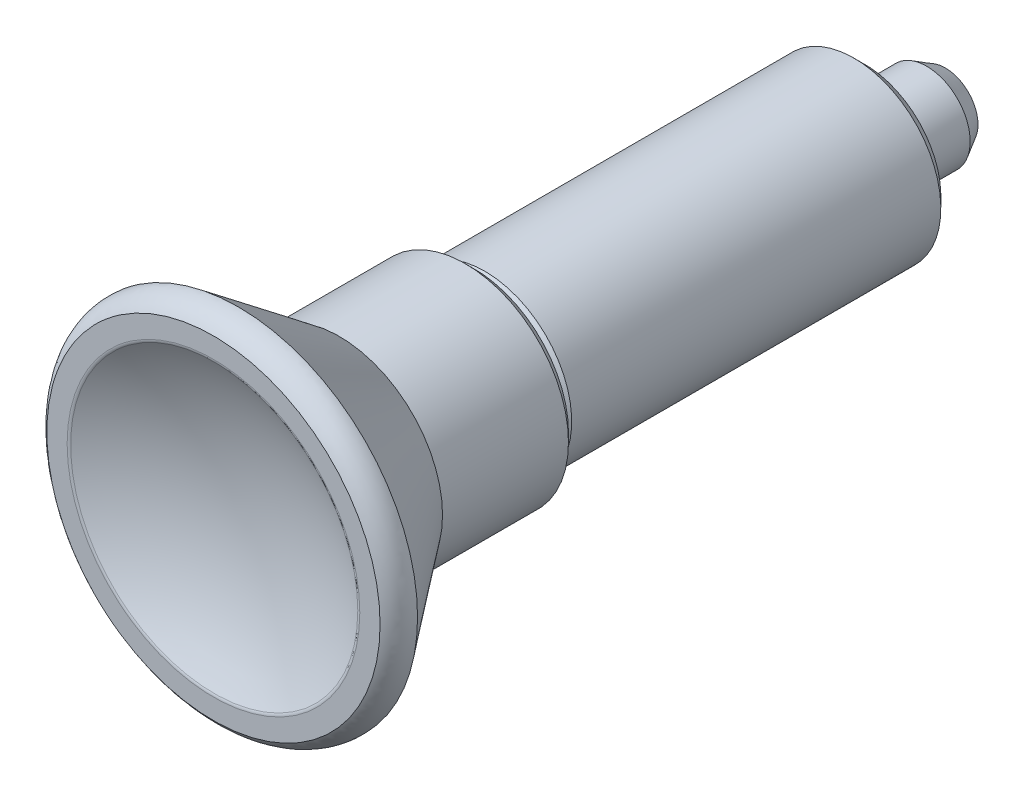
ISO-10303-21;
HEADER;
FILE_DESCRIPTION(('STEP AP214'),'2;1');
FILE_NAME('part.step','',(''),(''),'','','');
FILE_SCHEMA(('AUTOMOTIVE_DESIGN { 1 0 10303 214 1 1 1 1 }'));
ENDSEC;
DATA;
#1=APPLICATION_CONTEXT('core data for automotive mechanical design processes');
#2=APPLICATION_PROTOCOL_DEFINITION('international standard','automotive_design',2000,#1);
#3=PRODUCT_CONTEXT('',#1,'mechanical');
#4=PRODUCT('Part','Part','',(#3));
#5=PRODUCT_RELATED_PRODUCT_CATEGORY('part','',(#4));
#6=PRODUCT_DEFINITION_FORMATION('','',#4);
#7=PRODUCT_DEFINITION_CONTEXT('part definition',#1,'design');
#8=PRODUCT_DEFINITION('design','',#6,#7);
#9=PRODUCT_DEFINITION_SHAPE('','',#8);
#10=(LENGTH_UNIT() NAMED_UNIT(*) SI_UNIT(.MILLI.,.METRE.));
#11=(NAMED_UNIT(*) PLANE_ANGLE_UNIT() SI_UNIT($,.RADIAN.));
#12=(NAMED_UNIT(*) SI_UNIT($,.STERADIAN.) SOLID_ANGLE_UNIT());
#13=UNCERTAINTY_MEASURE_WITH_UNIT(LENGTH_MEASURE(1.E-05),#10,'distance_accuracy_value','');
#14=(GEOMETRIC_REPRESENTATION_CONTEXT(3) GLOBAL_UNCERTAINTY_ASSIGNED_CONTEXT((#13)) GLOBAL_UNIT_ASSIGNED_CONTEXT((#10,
#11,#12)) REPRESENTATION_CONTEXT('',''));
#15=CARTESIAN_POINT('',(0.,0.,0.));
#16=DIRECTION('',(0.,0.,1.));
#17=DIRECTION('',(1.,0.,0.));
#18=AXIS2_PLACEMENT_3D('',#15,#16,#17);
#19=CARTESIAN_POINT('',(4.75487704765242E-11,-3.93907129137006E-10,4.89046303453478E-10));
#20=DIRECTION('',(-0.923728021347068,-0.383049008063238,0.));
#21=DIRECTION('',(0.,0.,-1.));
#22=AXIS2_PLACEMENT_3D('',#19,#20,#21);
#23=SPHERICAL_SURFACE('',#22,8.);
#24=CARTESIAN_POINT('',(0.,0.,-7.41135340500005));
#25=DIRECTION('',(0.,0.,1.));
#26=DIRECTION('',(0.923728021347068,0.383049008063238,0.));
#27=AXIS2_PLACEMENT_3D('',#24,#25,#26);
#28=CIRCLE('',#27,3.011949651);
#29=CARTESIAN_POINT('',(2.78222229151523,1.15372432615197,-7.41135340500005));
#30=VERTEX_POINT('',#29);
#31=EDGE_CURVE('E16',#30,#30,#28,.T.);
#32=ORIENTED_EDGE('',*,*,#31,.F.);
#33=EDGE_LOOP('',(#32));
#34=FACE_BOUND('',#33,.T.);
#35=ADVANCED_FACE('F12',(#34),#23,.T.);
#36=CARTESIAN_POINT('',(0.,0.,-7.41135340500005));
#37=DIRECTION('',(0.,0.,1.));
#38=DIRECTION('',(0.923728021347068,0.383049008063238,0.));
#39=AXIS2_PLACEMENT_3D('',#36,#37,#38);
#40=CONICAL_SURFACE('',#39,3.011949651,0.523598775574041);
#41=ORIENTED_EDGE('',*,*,#31,.T.);
#42=EDGE_LOOP('',(#41));
#43=FACE_BOUND('',#42,.T.);
#44=CARTESIAN_POINT('',(0.,0.,-5.7));
#45=DIRECTION('',(0.,0.,-1.));
#46=DIRECTION('',(-0.923728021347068,-0.383049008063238,0.));
#47=AXIS2_PLACEMENT_3D('',#44,#45,#46);
#48=CIRCLE('',#47,4.);
#49=CARTESIAN_POINT('',(-3.69491208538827,-1.53219603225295,-5.7));
#50=VERTEX_POINT('',#49);
#51=EDGE_CURVE('E29',#50,#50,#48,.F.);
#52=ORIENTED_EDGE('',*,*,#51,.F.);
#53=EDGE_LOOP('',(#52));
#54=FACE_BOUND('',#53,.T.);
#55=ADVANCED_FACE('F83',(#43,#54),#40,.T.);
#56=CARTESIAN_POINT('',(0.,0.,0.));
#57=DIRECTION('',(0.,0.,-1.));
#58=DIRECTION('',(-0.923728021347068,-0.383049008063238,0.));
#59=AXIS2_PLACEMENT_3D('',#56,#57,#58);
#60=CYLINDRICAL_SURFACE('',#59,4.);
#61=CARTESIAN_POINT('',(0.,0.,0.));
#62=DIRECTION('',(0.,0.,-1.));
#63=DIRECTION('',(-0.923728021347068,-0.383049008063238,0.));
#64=AXIS2_PLACEMENT_3D('',#61,#62,#63);
#65=CIRCLE('',#64,4.);
#66=CARTESIAN_POINT('',(-3.69491208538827,-1.53219603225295,0.));
#67=VERTEX_POINT('',#66);
#68=EDGE_CURVE('E33',#67,#67,#65,.F.);
#69=ORIENTED_EDGE('',*,*,#68,.F.);
#70=EDGE_LOOP('',(#69));
#71=FACE_BOUND('',#70,.T.);
#72=ORIENTED_EDGE('',*,*,#51,.T.);
#73=EDGE_LOOP('',(#72));
#74=FACE_BOUND('',#73,.T.);
#75=ADVANCED_FACE('F89',(#71,#74),#60,.T.);
#76=CARTESIAN_POINT('',(9.26654561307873,-3.8526867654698,0.));
#77=DIRECTION('',(0.,0.,-1.));
#78=DIRECTION('',(-0.923728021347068,-0.383049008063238,0.));
#79=AXIS2_PLACEMENT_3D('',#76,#77,#78);
#80=PLANE('',#79);
#81=ORIENTED_EDGE('',*,*,#68,.T.);
#82=EDGE_LOOP('',(#81));
#83=FACE_BOUND('',#82,.T.);
#84=CARTESIAN_POINT('',(0.,0.,0.));
#85=DIRECTION('',(0.,0.,1.));
#86=DIRECTION('',(0.923728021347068,0.383049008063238,0.));
#87=AXIS2_PLACEMENT_3D('',#84,#85,#86);
#88=CIRCLE('',#87,7.);
#89=CARTESIAN_POINT('',(6.46609614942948,2.68134305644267,0.));
#90=VERTEX_POINT('',#89);
#91=EDGE_CURVE('E31',#90,#90,#88,.T.);
#92=ORIENTED_EDGE('',*,*,#91,.F.);
#93=EDGE_LOOP('',(#92));
#94=FACE_BOUND('',#93,.T.);
#95=ADVANCED_FACE('F14',(#83,#94),#80,.T.);
#96=CARTESIAN_POINT('',(0.,0.,0.));
#97=DIRECTION('',(0.,0.,1.));
#98=DIRECTION('',(0.923728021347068,0.383049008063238,0.));
#99=AXIS2_PLACEMENT_3D('',#96,#97,#98);
#100=CONICAL_SURFACE('',#99,7.,0.785398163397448);
#101=CARTESIAN_POINT('',(0.,0.,1.));
#102=DIRECTION('',(0.,0.,-1.));
#103=DIRECTION('',(-0.923728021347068,-0.383049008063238,0.));
#104=AXIS2_PLACEMENT_3D('',#101,#102,#103);
#105=CIRCLE('',#104,8.);
#106=CARTESIAN_POINT('',(-7.38982417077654,-3.0643920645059,0.999999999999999));
#107=VERTEX_POINT('',#106);
#108=EDGE_CURVE('E25',#107,#107,#105,.F.);
#109=ORIENTED_EDGE('',*,*,#108,.F.);
#110=EDGE_LOOP('',(#109));
#111=FACE_BOUND('',#110,.T.);
#112=ORIENTED_EDGE('',*,*,#91,.T.);
#113=EDGE_LOOP('',(#112));
#114=FACE_BOUND('',#113,.T.);
#115=ADVANCED_FACE('F93',(#111,#114),#100,.T.);
#116=CARTESIAN_POINT('',(0.,0.,35.));
#117=DIRECTION('',(0.,0.,-1.));
#118=DIRECTION('',(-0.923728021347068,-0.383049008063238,0.));
#119=AXIS2_PLACEMENT_3D('',#116,#117,#118);
#120=CYLINDRICAL_SURFACE('',#119,8.);
#121=ORIENTED_EDGE('',*,*,#108,.T.);
#122=EDGE_LOOP('',(#121));
#123=FACE_BOUND('',#122,.T.);
#124=CARTESIAN_POINT('',(0.,0.,35.));
#125=DIRECTION('',(0.,0.,-1.));
#126=DIRECTION('',(-0.923728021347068,-0.383049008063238,0.));
#127=AXIS2_PLACEMENT_3D('',#124,#125,#126);
#128=CIRCLE('',#127,8.);
#129=CARTESIAN_POINT('',(-7.38982417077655,-3.0643920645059,35.));
#130=VERTEX_POINT('',#129);
#131=EDGE_CURVE('E20',#130,#130,#128,.F.);
#132=ORIENTED_EDGE('',*,*,#131,.F.);
#133=EDGE_LOOP('',(#132));
#134=FACE_BOUND('',#133,.T.);
#135=ADVANCED_FACE('F96',(#123,#134),#120,.T.);
#136=CARTESIAN_POINT('',(0.,0.,36.));
#137=DIRECTION('',(0.,0.,-1.));
#138=DIRECTION('',(0.383049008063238,-0.923728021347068,0.));
#139=AXIS2_PLACEMENT_3D('',#136,#137,#138);
#140=CONICAL_SURFACE('',#139,7.,0.785398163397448);
#141=ORIENTED_EDGE('',*,*,#131,.T.);
#142=EDGE_LOOP('',(#141));
#143=FACE_BOUND('',#142,.T.);
#144=CARTESIAN_POINT('',(0.,0.,36.));
#145=DIRECTION('',(0.,0.,-1.));
#146=DIRECTION('',(0.383049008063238,-0.923728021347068,0.));
#147=AXIS2_PLACEMENT_3D('',#144,#145,#146);
#148=CIRCLE('',#147,7.);
#149=CARTESIAN_POINT('',(2.68134305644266,-6.46609614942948,36.));
#150=VERTEX_POINT('',#149);
#151=EDGE_CURVE('E8',#150,#150,#148,.T.);
#152=ORIENTED_EDGE('',*,*,#151,.T.);
#153=EDGE_LOOP('',(#152));
#154=FACE_BOUND('',#153,.T.);
#155=ADVANCED_FACE('F99',(#143,#154),#140,.T.);
#156=CARTESIAN_POINT('',(-7.26954864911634E-13,0.,82.3153369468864));
#157=DIRECTION('',(0.,0.,-1.));
#158=DIRECTION('',(1.,0.,0.));
#159=AXIS2_PLACEMENT_3D('',#156,#157,#158);
#160=SPHERICAL_SURFACE('',#159,25.9999999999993);
#161=CARTESIAN_POINT('',(0.,0.,59.9304780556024));
#162=DIRECTION('',(0.,0.,-1.));
#163=DIRECTION('',(1.,0.,0.));
#164=AXIS2_PLACEMENT_3D('',#161,#162,#163);
#165=CIRCLE('',#164,13.2256603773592);
#166=CARTESIAN_POINT('',(13.2256603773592,0.,59.9304780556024));
#167=VERTEX_POINT('',#166);
#168=EDGE_CURVE('E74',#167,#167,#165,.T.);
#169=ORIENTED_EDGE('',*,*,#168,.F.);
#170=EDGE_LOOP('',(#169));
#171=FACE_BOUND('',#170,.T.);
#172=ADVANCED_FACE('F85',(#171),#160,.F.);
#173=CARTESIAN_POINT('',(13.2256603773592,0.,59.9304780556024));
#174=CARTESIAN_POINT('',(13.3433285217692,0.,60.0000000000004));
#175=CARTESIAN_POINT('',(13.48,0.,60.));
#176=CARTESIAN_POINT('',(13.2256603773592,-22.9075157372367,59.9304780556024));
#177=CARTESIAN_POINT('',(13.3433285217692,-23.1113229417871,60.0000000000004));
#178=CARTESIAN_POINT('',(13.48,-23.3480448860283,60.));
#179=CARTESIAN_POINT('',(-6.6128301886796,-11.4537578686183,59.9304780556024));
#180=CARTESIAN_POINT('',(-6.6716642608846,-11.5556614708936,60.0000000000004));
#181=CARTESIAN_POINT('',(-6.74,-11.6740224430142,60.));
#182=CARTESIAN_POINT('',(-26.4513207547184,0.,59.9304780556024));
#183=CARTESIAN_POINT('',(-26.6866570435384,0.,60.0000000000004));
#184=CARTESIAN_POINT('',(-26.96,0.,60.));
#185=CARTESIAN_POINT('',(-6.61283018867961,11.4537578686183,59.9304780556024));
#186=CARTESIAN_POINT('',(-6.67166426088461,11.5556614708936,60.0000000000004));
#187=CARTESIAN_POINT('',(-6.74,11.6740224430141,60.));
#188=CARTESIAN_POINT('',(13.2256603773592,22.9075157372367,59.9304780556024));
#189=CARTESIAN_POINT('',(13.3433285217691,23.1113229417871,60.0000000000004));
#190=CARTESIAN_POINT('',(13.48,23.3480448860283,60.));
#191=CARTESIAN_POINT('',(13.2256603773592,0.,59.9304780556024));
#192=CARTESIAN_POINT('',(13.3433285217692,0.,60.0000000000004));
#193=CARTESIAN_POINT('',(13.48,0.,60.));
#194=(BOUNDED_SURFACE() B_SPLINE_SURFACE(2,2,((#173,#174,#175),(#176,#177,#178),(#179,#180,
#181),(#182,#183,#184),(#185,#186,#187),(#188,#189,#190),(#191,#192,#193)),.UNSPECIFIED.,.T.,
.F.,.F.) B_SPLINE_SURFACE_WITH_KNOTS((3,2,2,3),(3,3),(0.,169.162579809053,338.325159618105,
507.487739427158),(0.,1.),
.UNSPECIFIED.) GEOMETRIC_REPRESENTATION_ITEM() RATIONAL_B_SPLINE_SURFACE(((1.,0.964612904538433,
1.),(0.5,0.482306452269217,0.5),(1.,0.964612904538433,1.),(0.5,0.482306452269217,0.5),(1.,
0.964612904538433,1.),(0.5,0.482306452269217,0.5),(1.,0.964612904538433,1.))) REPRESENTATION_ITEM('') SURFACE());
#195=CARTESIAN_POINT('',(0.,0.,60.));
#196=DIRECTION('',(0.,0.,-1.));
#197=DIRECTION('',(1.,0.,0.));
#198=AXIS2_PLACEMENT_3D('',#195,#196,#197);
#199=CIRCLE('',#198,13.48);
#200=CARTESIAN_POINT('',(13.48,0.,60.));
#201=VERTEX_POINT('',#200);
#202=EDGE_CURVE('E67',#201,#201,#199,.T.);
#203=CARTESIAN_POINT('',(13.2256603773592,0.,59.9304780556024));
#204=CARTESIAN_POINT('',(13.2280276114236,0.,59.9318766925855));
#205=CARTESIAN_POINT('',(13.2304063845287,0.,59.933255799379));
#206=CARTESIAN_POINT('',(13.2351913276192,0.,59.9359774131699));
#207=CARTESIAN_POINT('',(13.2375975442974,0.,59.937319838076));
#208=CARTESIAN_POINT('',(13.2424365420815,0.,59.9399672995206));
#209=CARTESIAN_POINT('',(13.2448693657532,0.,59.9412722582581));
#210=CARTESIAN_POINT('',(13.249760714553,0.,59.9438440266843));
#211=CARTESIAN_POINT('',(13.25221927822,0.,59.9451107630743));
#212=CARTESIAN_POINT('',(13.2571612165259,0.,59.9476053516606));
#213=CARTESIAN_POINT('',(13.2596446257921,0.,59.9488331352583));
#214=CARTESIAN_POINT('',(13.2646353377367,0.,59.9512491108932));
#215=CARTESIAN_POINT('',(13.2671426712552,0.,59.9524372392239));
#216=CARTESIAN_POINT('',(13.2721802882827,0.,59.9547732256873));
#217=CARTESIAN_POINT('',(13.2747105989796,0.,59.9559210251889));
#218=CARTESIAN_POINT('',(13.2797932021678,0.,59.9581757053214));
#219=CARTESIAN_POINT('',(13.2823455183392,0.,59.9592825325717));
#220=CARTESIAN_POINT('',(13.2874711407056,0.,59.9614546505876));
#221=CARTESIAN_POINT('',(13.2900444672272,0.,59.9625198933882));
#222=CARTESIAN_POINT('',(13.2952110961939,0.,59.9646082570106));
#223=CARTESIAN_POINT('',(13.2978044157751,0.,59.9656313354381));
#224=CARTESIAN_POINT('',(13.3030099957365,0.,59.9676348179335));
#225=CARTESIAN_POINT('',(13.3056222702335,0.,59.9686151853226));
#226=CARTESIAN_POINT('',(13.3108647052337,0.,59.9705327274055));
#227=CARTESIAN_POINT('',(13.3134948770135,0.,59.9714698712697));
#228=CARTESIAN_POINT('',(13.3187720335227,0.,59.9733004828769));
#229=CARTESIAN_POINT('',(13.3214190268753,0.,59.9741939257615));
#230=CARTESIAN_POINT('',(13.3267287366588,0.,59.975936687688));
#231=CARTESIAN_POINT('',(13.329391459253,0.,59.9767859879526));
#232=CARTESIAN_POINT('',(13.3347315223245,0.,59.9784400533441));
#233=CARTESIAN_POINT('',(13.3374088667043,0.,59.9792448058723));
#234=CARTESIAN_POINT('',(13.3427770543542,0.,59.9808094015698));
#235=CARTESIAN_POINT('',(13.3454678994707,0.,59.9815692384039));
#236=CARTESIAN_POINT('',(13.3508619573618,0.,59.9830436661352));
#237=CARTESIAN_POINT('',(13.3535651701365,0.,59.9837582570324));
#238=CARTESIAN_POINT('',(13.3589828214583,0.,59.9851418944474));
#239=CARTESIAN_POINT('',(13.3616972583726,0.,59.9858109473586));
#240=CARTESIAN_POINT('',(13.3671362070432,0.,59.9871032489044));
#241=CARTESIAN_POINT('',(13.3698607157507,0.,59.9877265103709));
#242=CARTESIAN_POINT('',(13.3753186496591,0.,59.9889270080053));
#243=CARTESIAN_POINT('',(13.3780520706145,0.,59.9895042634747));
#244=CARTESIAN_POINT('',(13.3835266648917,0.,59.9906125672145));
#245=CARTESIAN_POINT('',(13.3862678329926,0.,59.9911436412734));
#246=CARTESIAN_POINT('',(13.3917567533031,0.,59.992159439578));
#247=CARTESIAN_POINT('',(13.394504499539,0.,59.9926441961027));
#248=CARTESIAN_POINT('',(13.4000054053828,0.,59.9935672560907));
#249=CARTESIAN_POINT('',(13.4027585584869,0.,59.9940055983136));
#250=CARTESIAN_POINT('',(13.4082691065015,0.,59.9948357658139));
#251=CARTESIAN_POINT('',(13.4110264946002,0.,59.9952276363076));
#252=CARTESIAN_POINT('',(13.4165443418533,0.,59.9959648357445));
#253=CARTESIAN_POINT('',(13.4193047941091,0.,59.9963102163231));
#254=CARTESIAN_POINT('',(13.4248276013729,0.,59.996954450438));
#255=CARTESIAN_POINT('',(13.4275899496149,0.,59.9972533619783));
#256=CARTESIAN_POINT('',(13.4331153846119,0.,59.9978047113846));
#257=CARTESIAN_POINT('',(13.43587846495,0.,59.9980572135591));
#258=CARTESIAN_POINT('',(13.4414042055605,0.,59.9985158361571));
#259=CARTESIAN_POINT('',(13.4441668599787,0.,59.9987220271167));
#260=CARTESIAN_POINT('',(13.4496905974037,0.,59.9990881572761));
#261=CARTESIAN_POINT('',(13.4524516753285,0.,59.9992481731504));
#262=CARTESIAN_POINT('',(13.4579711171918,0.,59.9995221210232));
#263=CARTESIAN_POINT('',(13.4607294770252,0.,59.9996361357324));
#264=CARTESIAN_POINT('',(13.466242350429,0.,59.9998182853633));
#265=CARTESIAN_POINT('',(13.4689968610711,0.,59.9998865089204));
#266=CARTESIAN_POINT('',(13.4745009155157,0.,59.9999773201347));
#267=CARTESIAN_POINT('',(13.4772504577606,0.,60.0000000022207));
#268=CARTESIAN_POINT('',(13.48,0.,60.));
#269=B_SPLINE_CURVE_WITH_KNOTS('',3,(#203,#204,#205,#206,#207,#208,#209,#210,#211,#212,#213,
#214,#215,#216,#217,#218,#219,#220,#221,#222,#223,#224,#225,#226,#227,#228,#229,#230,#231,#232,
#233,#234,#235,#236,#237,#238,#239,#240,#241,#242,#243,#244,#245,#246,#247,#248,#249,#250,#251,
#252,#253,#254,#255,#256,#257,#258,#259,#260,#261,#262,#263,#264,#265,#266,#267,#268),
.UNSPECIFIED.,.F.,.F.,(4,2,2,2,2,2,2,2,2,2,2,2,2,2,2,2,2,2,2,2,2,2,2,2,2,2,2,2,2,2,2,2,4),(0.,
0.00824853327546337,0.0165142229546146,0.0247959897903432,0.0330927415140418,0.0414033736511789,
0.0497267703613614,0.058061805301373,0.0664073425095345,0.0747622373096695,0.083125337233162,
0.0914954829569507,0.0998715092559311,0.108252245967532,0.116636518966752,0.125023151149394,
0.133410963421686,0.141798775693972,0.15018540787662,0.158569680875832,0.166950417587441,
0.175326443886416,0.183696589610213,0.192059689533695,0.200414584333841,0.208760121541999,
0.217095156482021,0.225418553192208,0.23372918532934,0.242025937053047,0.250307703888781,
0.258573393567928,0.2668219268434),.UNSPECIFIED.);
#270=EDGE_CURVE('BSEAM108',#167,#201,#269,.T.);
#271=ORIENTED_EDGE('',*,*,#168,.T.);
#272=ORIENTED_EDGE('',*,*,#202,.F.);
#273=ORIENTED_EDGE('',*,*,#270,.T.);
#274=ORIENTED_EDGE('',*,*,#270,.F.);
#275=EDGE_LOOP('',(#271,#273,#272,#274));
#276=FACE_BOUND('',#275,.T.);
#277=ADVANCED_FACE('F108',(#276),#194,.T.);
#278=CARTESIAN_POINT('',(-16.885,-16.885,60.));
#279=DIRECTION('',(0.,0.,1.));
#280=DIRECTION('',(1.,0.,0.));
#281=AXIS2_PLACEMENT_3D('',#278,#279,#280);
#282=PLANE('',#281);
#283=CARTESIAN_POINT('',(0.,0.,60.));
#284=DIRECTION('',(0.,0.,-1.));
#285=DIRECTION('',(1.,0.,0.));
#286=AXIS2_PLACEMENT_3D('',#283,#284,#285);
#287=CIRCLE('',#286,15.35);
#288=CARTESIAN_POINT('',(15.35,0.,60.));
#289=VERTEX_POINT('',#288);
#290=EDGE_CURVE('E62',#289,#289,#287,.T.);
#291=ORIENTED_EDGE('',*,*,#290,.F.);
#292=EDGE_LOOP('',(#291));
#293=FACE_BOUND('',#292,.T.);
#294=ORIENTED_EDGE('',*,*,#202,.T.);
#295=EDGE_LOOP('',(#294));
#296=FACE_BOUND('',#295,.T.);
#297=ADVANCED_FACE('F116',(#293,#296),#282,.T.);
#298=CARTESIAN_POINT('',(15.35,0.,60.));
#299=CARTESIAN_POINT('',(16.6156543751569,0.,59.1898669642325));
#300=CARTESIAN_POINT('',(16.5,0.,57.7));
#301=CARTESIAN_POINT('',(15.35,-26.5869798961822,60.));
#302=CARTESIAN_POINT('',(16.615654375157,-28.779157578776,59.1898669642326));
#303=CARTESIAN_POINT('',(16.5,-28.5788383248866,57.7));
#304=CARTESIAN_POINT('',(-7.675,-13.2934899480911,60.));
#305=CARTESIAN_POINT('',(-8.30782718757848,-14.389578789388,59.1898669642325));
#306=CARTESIAN_POINT('',(-8.25,-14.2894191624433,57.7));
#307=CARTESIAN_POINT('',(-30.7,0.,60.));
#308=CARTESIAN_POINT('',(-33.2313087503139,0.,59.1898669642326));
#309=CARTESIAN_POINT('',(-33.,0.,57.7));
#310=CARTESIAN_POINT('',(-7.675,13.2934899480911,60.));
#311=CARTESIAN_POINT('',(-8.30782718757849,14.389578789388,59.1898669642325));
#312=CARTESIAN_POINT('',(-8.25,14.2894191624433,57.7));
#313=CARTESIAN_POINT('',(15.35,26.5869798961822,60.));
#314=CARTESIAN_POINT('',(16.6156543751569,28.779157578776,59.1898669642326));
#315=CARTESIAN_POINT('',(16.5,28.5788383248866,57.7));
#316=CARTESIAN_POINT('',(15.35,0.,60.));
#317=CARTESIAN_POINT('',(16.6156543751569,0.,59.1898669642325));
#318=CARTESIAN_POINT('',(16.5,0.,57.7));
#319=(BOUNDED_SURFACE() B_SPLINE_SURFACE(2,2,((#298,#299,#300),(#301,#302,#303),(#304,#305,
#306),(#307,#308,#309),(#310,#311,#312),(#313,#314,#315),(#316,#317,#318)),.UNSPECIFIED.,.T.,
.F.,.F.) B_SPLINE_SURFACE_WITH_KNOTS((3,2,2,3),(3,3),(0.,18.7749492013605,37.5498984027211,
56.3248476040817),(0.,1.),
.UNSPECIFIED.) GEOMETRIC_REPRESENTATION_ITEM() RATIONAL_B_SPLINE_SURFACE(((1.,0.857079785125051,
1.),(0.5,0.428539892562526,0.5),(1.,0.857079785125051,1.),(0.5,0.428539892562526,0.5),(1.,
0.857079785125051,1.),(0.5,0.428539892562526,0.5),(1.,0.857079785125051,1.))) REPRESENTATION_ITEM('') SURFACE());
#320=CARTESIAN_POINT('',(0.,0.,57.7));
#321=DIRECTION('',(0.,0.,1.));
#322=DIRECTION('',(1.,0.,0.));
#323=AXIS2_PLACEMENT_3D('',#320,#321,#322);
#324=CIRCLE('',#323,16.5);
#325=CARTESIAN_POINT('',(16.5,0.,57.7));
#326=VERTEX_POINT('',#325);
#327=EDGE_CURVE('E63',#326,#326,#324,.T.);
#328=CARTESIAN_POINT('',(15.35,0.,60.));
#329=CARTESIAN_POINT('',(15.3556561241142,0.,59.9963795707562));
#330=CARTESIAN_POINT('',(15.3612977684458,0.,59.992736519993));
#331=CARTESIAN_POINT('',(15.3725641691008,0.,59.9853973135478));
#332=CARTESIAN_POINT('',(15.3781888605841,0.,59.9817010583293));
#333=CARTESIAN_POINT('',(15.3894206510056,0.,59.9742554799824));
#334=CARTESIAN_POINT('',(15.395027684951,0.,59.9705060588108));
#335=CARTESIAN_POINT('',(15.4062234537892,0.,59.9629541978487));
#336=CARTESIAN_POINT('',(15.4118121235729,0.,59.9591516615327));
#337=CARTESIAN_POINT('',(15.4229704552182,0.,59.9514936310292));
#338=CARTESIAN_POINT('',(15.4285400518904,0.,59.9476380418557));
#339=CARTESIAN_POINT('',(15.4396595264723,0.,59.9398739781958));
#340=CARTESIAN_POINT('',(15.4452093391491,0.,59.9359654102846));
#341=CARTESIAN_POINT('',(15.4562885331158,0.,59.92809547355));
#342=CARTESIAN_POINT('',(15.4618178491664,0.,59.9241340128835));
#343=CARTESIAN_POINT('',(15.4728553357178,0.,59.9161583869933));
#344=CARTESIAN_POINT('',(15.4783634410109,0.,59.9121441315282));
#345=CARTESIAN_POINT('',(15.489357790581,0.,59.9040630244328));
#346=CARTESIAN_POINT('',(15.4948439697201,0.,59.8999960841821));
#347=CARTESIAN_POINT('',(15.5057937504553,0.,59.8918097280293));
#348=CARTESIAN_POINT('',(15.5112572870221,0.,59.8876902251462));
#349=CARTESIAN_POINT('',(15.5221610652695,0.,59.8793988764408));
#350=CARTESIAN_POINT('',(15.527601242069,0.,59.8752269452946));
#351=CARTESIAN_POINT('',(15.538457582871,0.,59.8668308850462));
#352=CARTESIAN_POINT('',(15.5438736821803,0.,59.8626066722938));
#353=CARTESIAN_POINT('',(15.5546811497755,0.,59.8541062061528));
#354=CARTESIAN_POINT('',(15.5600724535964,0.,59.8498298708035));
#355=CARTESIAN_POINT('',(15.5708296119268,0.,59.8412253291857));
#356=CARTESIAN_POINT('',(15.5761954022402,0.,59.8368970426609));
#357=CARTESIAN_POINT('',(15.5869008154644,0.,59.8281887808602));
#358=CARTESIAN_POINT('',(15.592240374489,0.,59.8238087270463));
#359=CARTESIAN_POINT('',(15.6028926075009,0.,59.814997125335));
#360=CARTESIAN_POINT('',(15.6082052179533,0.,59.810565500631));
#361=CARTESIAN_POINT('',(15.6188028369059,0.,59.801650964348));
#362=CARTESIAN_POINT('',(15.6240877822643,0.,59.7971679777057));
#363=CARTESIAN_POINT('',(15.634629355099,0.,59.7881509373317));
#364=CARTESIAN_POINT('',(15.6398859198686,0.,59.783616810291));
#365=CARTESIAN_POINT('',(15.6503700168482,0.,59.7744977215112));
#366=CARTESIAN_POINT('',(15.655597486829,0.,59.7699126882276));
#367=CARTESIAN_POINT('',(15.6660226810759,0.,59.7606920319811));
#368=CARTESIAN_POINT('',(15.6712203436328,0.,59.7560563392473));
#369=CARTESIAN_POINT('',(15.6815852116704,0.,59.7467346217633));
#370=CARTESIAN_POINT('',(15.6867523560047,0.,59.742048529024));
#371=CARTESIAN_POINT('',(15.6970554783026,0.,59.732626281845));
#372=CARTESIAN_POINT('',(15.7021913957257,0.,59.7278900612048));
#373=CARTESIAN_POINT('',(15.7124313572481,0.,59.7183678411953));
#374=CARTESIAN_POINT('',(15.717535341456,0.,59.71358177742));
#375=CARTESIAN_POINT('',(15.7277107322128,0.,59.7039601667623));
#376=CARTESIAN_POINT('',(15.7327820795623,0.,59.6991245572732));
#377=CARTESIAN_POINT('',(15.7428914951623,0.,59.689404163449));
#378=CARTESIAN_POINT('',(15.7479295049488,0.,59.68451931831));
#379=CARTESIAN_POINT('',(15.7579715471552,0.,59.6747007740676));
#380=CARTESIAN_POINT('',(15.7629755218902,0.,59.6697670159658));
#381=CARTESIAN_POINT('',(15.7729487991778,0.,59.6598509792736));
#382=CARTESIAN_POINT('',(15.7779180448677,0.,59.6548686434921));
#383=CARTESIAN_POINT('',(15.7878211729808,0.,59.6448557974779));
#384=CARTESIAN_POINT('',(15.7927549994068,0.,59.6398252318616));
#385=CARTESIAN_POINT('',(15.8025866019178,0.,59.6297162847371));
#386=CARTESIAN_POINT('',(15.8074843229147,0.,59.6246378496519));
#387=CARTESIAN_POINT('',(15.817243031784,0.,59.6144335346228));
#388=CARTESIAN_POINT('',(15.8221039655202,0.,59.6093076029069));
#389=CARTESIAN_POINT('',(15.8317884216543,0.,59.5990086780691));
#390=CARTESIAN_POINT('',(15.8366118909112,0.,59.593835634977));
#391=CARTESIAN_POINT('',(15.8462207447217,0.,59.5834428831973));
#392=CARTESIAN_POINT('',(15.8510060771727,0.,59.5782231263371));
#393=CARTESIAN_POINT('',(15.8605379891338,0.,59.5677373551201));
#394=CARTESIAN_POINT('',(15.8652845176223,0.,59.5624712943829));
#395=CARTESIAN_POINT('',(15.8747381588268,0.,59.5518933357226));
#396=CARTESIAN_POINT('',(15.8794452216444,0.,59.5465813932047));
#397=CARTESIAN_POINT('',(15.8888192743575,0.,59.535912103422));
#398=CARTESIAN_POINT('',(15.8934862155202,0.,59.5305547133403));
#399=CARTESIAN_POINT('',(15.9027793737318,0.,59.5197949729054));
#400=CARTESIAN_POINT('',(15.9074055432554,0.,59.5143925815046));
#401=CARTESIAN_POINT('',(15.9166165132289,0.,59.5035432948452));
#402=CARTESIAN_POINT('',(15.9212012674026,0.,59.4980963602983));
#403=CARTESIAN_POINT('',(15.9303287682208,0.,59.4871584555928));
#404=CARTESIAN_POINT('',(15.9348714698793,0.,59.4816674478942));
#405=CARTESIAN_POINT('',(15.9439142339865,0.,59.4706418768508));
#406=CARTESIAN_POINT('',(15.9484142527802,0.,59.4651072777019));
#407=CARTESIAN_POINT('',(15.9573710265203,0.,59.4539950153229));
#408=CARTESIAN_POINT('',(15.9618277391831,0.,59.448417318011));
#409=CARTESIAN_POINT('',(15.9706972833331,0.,59.4372193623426));
#410=CARTESIAN_POINT('',(15.9751100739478,0.,59.4315990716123));
#411=CARTESIAN_POINT('',(15.9838911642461,0.,59.4203164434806));
#412=CARTESIAN_POINT('',(15.9882594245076,0.,59.4146540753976));
#413=CARTESIAN_POINT('',(15.9969508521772,0.,59.4032878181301));
#414=CARTESIAN_POINT('',(16.0012739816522,0.,59.3975838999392));
#415=CARTESIAN_POINT('',(16.0098745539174,0.,59.3861350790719));
#416=CARTESIAN_POINT('',(16.0141519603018,0.,59.3803901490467));
#417=CARTESIAN_POINT('',(16.0226605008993,0.,59.3688598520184));
#418=CARTESIAN_POINT('',(16.0268916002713,0.,59.3630744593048));
#419=CARTESIAN_POINT('',(16.035306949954,0.,59.3514637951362));
#420=CARTESIAN_POINT('',(16.0394911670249,0.,59.3456384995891));
#421=CARTESIAN_POINT('',(16.0478121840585,0.,59.3339485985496));
#422=CARTESIAN_POINT('',(16.0519489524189,0.,59.3280839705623));
#423=CARTESIAN_POINT('',(16.0601745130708,0.,59.3163159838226));
#424=CARTESIAN_POINT('',(16.0642632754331,0.,59.3104126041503));
#425=CARTESIAN_POINT('',(16.072392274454,0.,59.2985677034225));
#426=CARTESIAN_POINT('',(16.0764324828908,0.,59.2926261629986));
#427=CARTESIAN_POINT('',(16.0844638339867,0.,59.2807055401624));
#428=CARTESIAN_POINT('',(16.088454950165,0.,59.2747264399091));
#429=CARTESIAN_POINT('',(16.0963875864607,0.,59.2627313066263));
#430=CARTESIAN_POINT('',(16.1003290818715,0.,59.256715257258));
#431=CARTESIAN_POINT('',(16.1081619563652,0.,59.2446468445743));
#432=CARTESIAN_POINT('',(16.1120533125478,0.,59.2385944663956));
#433=CARTESIAN_POINT('',(16.1197853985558,0.,59.2264540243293));
#434=CARTESIAN_POINT('',(16.1236261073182,0.,59.2203659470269));
#435=CARTESIAN_POINT('',(16.131256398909,0.,59.208154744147));
#436=CARTESIAN_POINT('',(16.1350459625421,0.,59.2020316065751));
#437=CARTESIAN_POINT('',(16.1425734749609,0.,59.189750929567));
#438=CARTESIAN_POINT('',(16.1463114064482,0.,59.1835933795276));
#439=CARTESIAN_POINT('',(16.15373517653,0.,59.1712445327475));
#440=CARTESIAN_POINT('',(16.1574209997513,0.,59.1650532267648));
#441=CARTESIAN_POINT('',(16.1647400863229,0.,59.1526375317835));
#442=CARTESIAN_POINT('',(16.1683733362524,0.,59.1464131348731));
#443=CARTESIAN_POINT('',(16.175586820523,0.,59.1339319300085));
#444=CARTESIAN_POINT('',(16.1791670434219,0.,59.1276751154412));
#445=CARTESIAN_POINT('',(16.1862740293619,0.,59.1151297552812));
#446=CARTESIAN_POINT('',(16.1898007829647,0.,59.1088412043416));
#447=CARTESIAN_POINT('',(16.196800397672,0.,59.0962330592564));
#448=CARTESIAN_POINT('',(16.2002732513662,0.,59.0899134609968));
#449=CARTESIAN_POINT('',(16.2071646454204,0.,59.0772439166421));
#450=CARTESIAN_POINT('',(16.210583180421,0.,59.0708939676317));
#451=CARTESIAN_POINT('',(16.2173655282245,0.,59.0581644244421));
#452=CARTESIAN_POINT('',(16.2207293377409,0.,59.0517848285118));
#453=CARTESIAN_POINT('',(16.2274018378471,0.,59.038996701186));
#454=CARTESIAN_POINT('',(16.2307105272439,0.,59.032588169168));
#455=CARTESIAN_POINT('',(16.237272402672,0.,59.0197428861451));
#456=CARTESIAN_POINT('',(16.2405255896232,0.,59.01330613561));
#457=CARTESIAN_POINT('',(16.2469760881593,0.,59.0004051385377));
#458=CARTESIAN_POINT('',(16.2501734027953,0.,58.993940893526));
#459=CARTESIAN_POINT('',(16.2565117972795,0.,58.9809856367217));
#460=CARTESIAN_POINT('',(16.2596528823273,0.,58.9744946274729));
#461=CARTESIAN_POINT('',(16.2658784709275,0.,58.9614865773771));
#462=CARTESIAN_POINT('',(16.2689629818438,0.,58.9549695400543));
#463=CARTESIAN_POINT('',(16.275075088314,0.,58.9419101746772));
#464=CARTESIAN_POINT('',(16.2781026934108,0.,58.9353678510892));
#465=CARTESIAN_POINT('',(16.2841006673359,0.,58.9222586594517));
#466=CARTESIAN_POINT('',(16.2870710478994,0.,58.9156917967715));
#467=CARTESIAN_POINT('',(16.2929542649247,0.,58.9025342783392));
#468=CARTESIAN_POINT('',(16.2958671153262,0.,58.89594362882));
#469=CARTESIAN_POINT('',(16.3016349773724,0.,58.8827392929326));
#470=CARTESIAN_POINT('',(16.3044900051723,0.,58.8761256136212));
#471=CARTESIAN_POINT('',(16.3101419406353,0.,58.8628759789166));
#472=CARTESIAN_POINT('',(16.3129388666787,0.,58.856240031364));
#473=CARTESIAN_POINT('',(16.3184743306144,0.,58.8429466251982));
#474=CARTESIAN_POINT('',(16.3212128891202,0.,58.8362891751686));
#475=CARTESIAN_POINT('',(16.3266313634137,0.,58.8229535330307));
#476=CARTESIAN_POINT('',(16.3293113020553,0.,58.8162753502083));
#477=CARTESIAN_POINT('',(16.3346122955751,0.,58.8028990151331));
#478=CARTESIAN_POINT('',(16.3372333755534,0.,58.7962008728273));
#479=CARTESIAN_POINT('',(16.3424164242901,0.,58.7827853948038));
#480=CARTESIAN_POINT('',(16.3449784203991,0.,58.7760680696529));
#481=CARTESIAN_POINT('',(16.3500430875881,0.,58.7626150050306));
#482=CARTESIAN_POINT('',(16.3525457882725,0.,58.7558792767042));
#483=CARTESIAN_POINT('',(16.357491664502,0.,58.7423901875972));
#484=CARTESIAN_POINT('',(16.3599348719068,0.,58.7356368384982));
#485=CARTESIAN_POINT('',(16.364761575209,0.,58.7221132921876));
#486=CARTESIAN_POINT('',(16.367145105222,0.,58.7153431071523));
#487=CARTESIAN_POINT('',(16.3718522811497,0.,58.7017866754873));
#488=CARTESIAN_POINT('',(16.3741759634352,0.,58.6950004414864));
#489=CARTESIAN_POINT('',(16.3787632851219,0.,58.6814127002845));
#490=CARTESIAN_POINT('',(16.3810269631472,0.,58.6746112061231));
#491=CARTESIAN_POINT('',(16.3854941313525,0.,58.6609937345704));
#492=CARTESIAN_POINT('',(16.3876976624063,0.,58.6541777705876));
#493=CARTESIAN_POINT('',(16.3920444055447,0.,58.6405321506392));
#494=CARTESIAN_POINT('',(16.3941876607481,0.,58.6337025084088));
#495=CARTESIAN_POINT('',(16.3984137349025,0.,58.6200303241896));
#496=CARTESIAN_POINT('',(16.4004965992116,0.,58.6131877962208));
#497=CARTESIAN_POINT('',(16.404601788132,0.,58.5994906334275));
#498=CARTESIAN_POINT('',(16.4066241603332,0.,58.5926360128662));
#499=CARTESIAN_POINT('',(16.4106082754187,0.,58.5789154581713));
#500=CARTESIAN_POINT('',(16.4125700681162,0.,58.5720495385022));
#501=CARTESIAN_POINT('',(16.4164329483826,0.,58.5583071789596));
#502=CARTESIAN_POINT('',(16.4183340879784,0.,58.5514307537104));
#503=CARTESIAN_POINT('',(16.4220756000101,0.,58.5376681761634));
#504=CARTESIAN_POINT('',(16.4239160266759,0.,58.5307820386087));
#505=CARTESIAN_POINT('',(16.4275360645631,0.,58.5170008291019));
#506=CARTESIAN_POINT('',(16.429315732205,0.,58.5101057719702));
#507=CARTESIAN_POINT('',(16.4328142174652,0.,58.4963075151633));
#508=CARTESIAN_POINT('',(16.4345330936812,0.,58.4894043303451));
#509=CARTESIAN_POINT('',(16.4379099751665,0.,58.4755906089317));
#510=CARTESIAN_POINT('',(16.4395680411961,0.,58.4686800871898));
#511=CARTESIAN_POINT('',(16.4428232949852,0.,58.4548524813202));
#512=CARTESIAN_POINT('',(16.4444205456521,0.,58.447935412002));
#513=CARTESIAN_POINT('',(16.4475541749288,0.,58.4340954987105));
#514=CARTESIAN_POINT('',(16.4490906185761,0.,58.4271726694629));
#515=CARTESIAN_POINT('',(16.4521026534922,0.,58.4133220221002));
#516=CARTESIAN_POINT('',(16.4535783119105,0.,58.4063942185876));
#517=CARTESIAN_POINT('',(16.4564688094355,0.,58.3925344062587));
#518=CARTESIAN_POINT('',(16.4578837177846,0.,58.385602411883));
#519=CARTESIAN_POINT('',(16.4606527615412,0.,58.3717349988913));
#520=CARTESIAN_POINT('',(16.4620069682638,0.,58.3647995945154));
#521=CARTESIAN_POINT('',(16.4646546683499,0.,58.3509261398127));
#522=CARTESIAN_POINT('',(16.4659482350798,0.,58.3439881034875));
#523=CARTESIAN_POINT('',(16.4684747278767,0.,58.3301101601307));
#524=CARTESIAN_POINT('',(16.4697077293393,0.,58.3231702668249));
#525=CARTESIAN_POINT('',(16.4721131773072,0.,58.3092893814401));
#526=CARTESIAN_POINT('',(16.4732857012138,0.,58.3023484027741));
#527=CARTESIAN_POINT('',(16.4755702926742,0.,58.2884661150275));
#528=CARTESIAN_POINT('',(16.4766824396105,0.,58.2815248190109));
#529=CARTESIAN_POINT('',(16.4788463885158,0.,58.2676426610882));
#530=CARTESIAN_POINT('',(16.4798982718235,0.,58.2607018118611));
#531=CARTESIAN_POINT('',(16.4819418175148,0.,58.2468213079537));
#532=CARTESIAN_POINT('',(16.4829335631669,0.,58.2398816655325));
#533=CARTESIAN_POINT('',(16.4848569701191,0.,58.2260043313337));
#534=CARTESIAN_POINT('',(16.4857887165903,0.,58.2190666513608));
#535=CARTESIAN_POINT('',(16.487592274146,0.,58.2051939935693));
#536=CARTESIAN_POINT('',(16.4884641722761,0.,58.1982590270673));
#537=CARTESIAN_POINT('',(16.4901481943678,0.,58.1843925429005));
#538=CARTESIAN_POINT('',(16.4909604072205,0.,58.1774610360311));
#539=CARTESIAN_POINT('',(16.4925252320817,0.,58.1636022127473));
#540=CARTESIAN_POINT('',(16.4932779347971,0.,58.1566749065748));
#541=CARTESIAN_POINT('',(16.4947239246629,0.,58.1428252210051));
#542=CARTESIAN_POINT('',(16.4954173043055,0.,58.1359028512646));
#543=CARTESIAN_POINT('',(16.4967448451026,0.,58.1220637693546));
#544=CARTESIAN_POINT('',(16.4973791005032,0.,58.1151470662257));
#545=CARTESIAN_POINT('',(16.4985886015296,0.,58.101320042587));
#546=CARTESIAN_POINT('',(16.4991639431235,0.,58.0944097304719));
#547=CARTESIAN_POINT('',(16.5002558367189,0.,58.0805962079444));
#548=CARTESIAN_POINT('',(16.5007724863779,0.,58.0736930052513));
#549=CARTESIAN_POINT('',(16.5017472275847,0.,58.0598944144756));
#550=CARTESIAN_POINT('',(16.5022054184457,0.,58.0529990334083));
#551=CARTESIAN_POINT('',(16.5030634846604,0.,58.0392167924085));
#552=CARTESIAN_POINT('',(16.503463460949,0.,58.0323299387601));
#553=CARTESIAN_POINT('',(16.5042053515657,0.,58.0185654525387));
#554=CARTESIAN_POINT('',(16.5045473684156,0.,58.0116878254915));
#555=CARTESIAN_POINT('',(16.5051736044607,0.,57.9979424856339));
#556=CARTESIAN_POINT('',(16.5054579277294,0.,57.9910747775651));
#557=CARTESIAN_POINT('',(16.5059690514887,0.,57.9773499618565));
#558=CARTESIAN_POINT('',(16.5061959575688,0.,57.9704928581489));
#559=CARTESIAN_POINT('',(16.5065925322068,0.,57.9567899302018));
#560=CARTESIAN_POINT('',(16.506762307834,0.,57.9499441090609));
#561=CARTESIAN_POINT('',(16.5070449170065,0.,57.9362644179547));
#562=CARTESIAN_POINT('',(16.507157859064,0.,57.9294305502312));
#563=CARTESIAN_POINT('',(16.5073271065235,0.,57.9157754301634));
#564=CARTESIAN_POINT('',(16.5073835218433,0.,57.9089541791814));
#565=CARTESIAN_POINT('',(16.5074400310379,0.,57.8953249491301));
#566=CARTESIAN_POINT('',(16.5074402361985,0.,57.8885169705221));
#567=CARTESIAN_POINT('',(16.5073846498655,0.,57.874914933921));
#568=CARTESIAN_POINT('',(16.5073289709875,0.,57.8681208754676));
#569=CARTESIAN_POINT('',(16.5071619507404,0.,57.8545473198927));
#570=CARTESIAN_POINT('',(16.5070507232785,0.,57.8477678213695));
#571=CARTESIAN_POINT('',(16.5067729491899,0.,57.8342240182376));
#572=CARTESIAN_POINT('',(16.5066065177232,0.,57.827459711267));
#573=CARTESIAN_POINT('',(16.5062186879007,0.,57.8139469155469));
#574=CARTESIAN_POINT('',(16.5059974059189,0.,57.8071984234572));
#575=CARTESIAN_POINT('',(16.5055002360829,0.,57.7937178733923));
#576=CARTESIAN_POINT('',(16.5052244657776,0.,57.7869858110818));
#577=CARTESIAN_POINT('',(16.5046186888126,0.,57.7735387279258));
#578=CARTESIAN_POINT('',(16.504288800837,0.,57.7668237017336));
#579=CARTESIAN_POINT('',(16.503575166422,0.,57.7534112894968));
#580=CARTESIAN_POINT('',(16.503191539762,0.,57.7467138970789));
#581=CARTESIAN_POINT('',(16.5023708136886,0.,57.7333373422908));
#582=CARTESIAN_POINT('',(16.5019338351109,0.,57.7266581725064));
#583=CARTESIAN_POINT('',(16.5010067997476,0.,57.713318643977));
#584=CARTESIAN_POINT('',(16.5005168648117,0.,57.7066582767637));
#585=CARTESIAN_POINT('',(16.5,0.,57.7));
#586=B_SPLINE_CURVE_WITH_KNOTS('',3,(#328,#329,#330,#331,#332,#333,#334,#335,#336,#337,#338,
#339,#340,#341,#342,#343,#344,#345,#346,#347,#348,#349,#350,#351,#352,#353,#354,#355,#356,#357,
#358,#359,#360,#361,#362,#363,#364,#365,#366,#367,#368,#369,#370,#371,#372,#373,#374,#375,#376,
#377,#378,#379,#380,#381,#382,#383,#384,#385,#386,#387,#388,#389,#390,#391,#392,#393,#394,#395,
#396,#397,#398,#399,#400,#401,#402,#403,#404,#405,#406,#407,#408,#409,#410,#411,#412,#413,#414,
#415,#416,#417,#418,#419,#420,#421,#422,#423,#424,#425,#426,#427,#428,#429,#430,#431,#432,#433,
#434,#435,#436,#437,#438,#439,#440,#441,#442,#443,#444,#445,#446,#447,#448,#449,#450,#451,#452,
#453,#454,#455,#456,#457,#458,#459,#460,#461,#462,#463,#464,#465,#466,#467,#468,#469,#470,#471,
#472,#473,#474,#475,#476,#477,#478,#479,#480,#481,#482,#483,#484,#485,#486,#487,#488,#489,#490,
#491,#492,#493,#494,#495,#496,#497,#498,#499,#500,#501,#502,#503,#504,#505,#506,#507,#508,#509,
#510,#511,#512,#513,#514,#515,#516,#517,#518,#519,#520,#521,#522,#523,#524,#525,#526,#527,#528,
#529,#530,#531,#532,#533,#534,#535,#536,#537,#538,#539,#540,#541,#542,#543,#544,#545,#546,#547,
#548,#549,#550,#551,#552,#553,#554,#555,#556,#557,#558,#559,#560,#561,#562,#563,#564,#565,#566,
#567,#568,#569,#570,#571,#572,#573,#574,#575,#576,#577,#578,#579,#580,#581,#582,#583,#584,#585),
.UNSPECIFIED.,.F.,.F.,(4,2,2,2,2,2,2,2,2,2,2,2,2,2,2,2,2,2,2,2,2,2,2,2,2,2,2,2,2,2,2,2,2,2,2,2,
2,2,2,2,2,2,2,2,2,2,2,2,2,2,2,2,2,2,2,2,2,2,2,2,2,2,2,2,2,2,2,2,2,2,2,2,2,2,2,2,2,2,2,2,2,2,2,2,
2,2,2,2,2,2,2,2,2,2,2,2,2,2,2,2,2,2,2,2,2,2,2,2,2,2,2,2,2,2,2,2,2,2,2,2,2,2,2,2,2,2,2,2,4),(0.,
0.020146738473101,0.0403379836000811,0.0605732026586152,0.0808518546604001,0.101173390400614,
0.121537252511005,0.141942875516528,0.162389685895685,0.182877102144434,0.203404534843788,
0.223971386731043,0.244577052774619,0.26522092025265,0.28590236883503,0.306620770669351,
0.327375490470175,0.348165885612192,0.368991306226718,0.38985109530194,0.410744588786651,
0.431671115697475,0.452629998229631,0.473620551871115,0.494642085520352,0.515693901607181,
0.536775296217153,0.557885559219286,0.579023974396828,0.600189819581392,0.62138236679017,
0.642600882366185,0.663844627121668,0.685112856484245,0.706404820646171,0.727719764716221,
0.749056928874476,0.77041554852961,0.791794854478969,0.813194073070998,0.834612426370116,
0.856049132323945,0.877503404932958,0.898974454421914,0.920461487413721,0.941963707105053,
0.963480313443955,0.985010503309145,1.00655347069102,1.02810840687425,1.04967450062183,
1.07125093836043,1.09283690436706,1.11443158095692,1.13603414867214,1.15764378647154,
1.17925967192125,1.20088098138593,1.22250689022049,1.24413657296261,1.26576920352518,
1.28740395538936,1.30904000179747,1.33067651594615,1.35231267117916,1.37394764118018,
1.39558060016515,1.4172107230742,1.43883718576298,1.46045916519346,1.48207583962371,
1.50368638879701,1.52528999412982,1.54688583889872,1.56847310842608,1.59005099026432,
1.61161867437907,1.63317535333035,1.65472022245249,1.67625248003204,1.69777132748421,
1.71927596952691,1.74076561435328,1.76223947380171,1.78369676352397,1.80513670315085,
1.82655851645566,1.84796143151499,1.86934468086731,1.89070750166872,1.9120491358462,
1.93336883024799,1.95466583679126,1.97593941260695,1.99718882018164,2.01841332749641,
2.03961220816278,2.0607847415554,2.08193021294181,2.10304791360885,2.12413714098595,
2.14519719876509,2.16622739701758,2.18722705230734,2.20819548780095,2.22913203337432,
2.25003602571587,2.2709068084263,2.29174373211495,2.31254615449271,2.33331344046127,
2.3540449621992,2.37474009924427,2.3953982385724,2.416018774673,2.43660110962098,
2.45714465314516,2.47764882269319,2.49811304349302,2.5185367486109,2.53891937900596,
2.55926038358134,2.57955921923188,2.59981535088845,2.62002825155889,2.64019740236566,
2.66032229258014,2.68040241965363,2.7004372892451),.UNSPECIFIED.);
#587=EDGE_CURVE('BSEAM123',#289,#326,#586,.T.);
#588=ORIENTED_EDGE('',*,*,#290,.T.);
#589=ORIENTED_EDGE('',*,*,#327,.T.);
#590=ORIENTED_EDGE('',*,*,#587,.T.);
#591=ORIENTED_EDGE('',*,*,#587,.F.);
#592=EDGE_LOOP('',(#588,#590,#589,#591));
#593=FACE_BOUND('',#592,.T.);
#594=ADVANCED_FACE('F123',(#593),#319,.T.);
#595=CARTESIAN_POINT('',(0.,0.,48.4));
#596=DIRECTION('',(0.,0.,1.));
#597=DIRECTION('',(1.,0.,0.));
#598=AXIS2_PLACEMENT_3D('',#595,#596,#597);
#599=CONICAL_SURFACE('',#598,9.5,0.645219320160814);
#600=ORIENTED_EDGE('',*,*,#327,.F.);
#601=EDGE_LOOP('',(#600));
#602=FACE_BOUND('',#601,.T.);
#603=CARTESIAN_POINT('',(0.,0.,48.4));
#604=DIRECTION('',(0.,0.,-1.));
#605=DIRECTION('',(1.,0.,0.));
#606=AXIS2_PLACEMENT_3D('',#603,#604,#605);
#607=CIRCLE('',#606,9.5);
#608=CARTESIAN_POINT('',(9.49999999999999,0.,48.4));
#609=VERTEX_POINT('',#608);
#610=EDGE_CURVE('E56',#609,#609,#607,.T.);
#611=ORIENTED_EDGE('',*,*,#610,.F.);
#612=EDGE_LOOP('',(#611));
#613=FACE_BOUND('',#612,.T.);
#614=ADVANCED_FACE('F130',(#602,#613),#599,.T.);
#615=CARTESIAN_POINT('',(0.,0.,48.4));
#616=DIRECTION('',(0.,0.,-1.));
#617=DIRECTION('',(1.,0.,0.));
#618=AXIS2_PLACEMENT_3D('',#615,#616,#617);
#619=CYLINDRICAL_SURFACE('',#618,9.5);
#620=CARTESIAN_POINT('',(0.,0.,36.8));
#621=DIRECTION('',(0.,0.,1.));
#622=DIRECTION('',(1.,0.,0.));
#623=AXIS2_PLACEMENT_3D('',#620,#621,#622);
#624=CIRCLE('',#623,9.5);
#625=CARTESIAN_POINT('',(9.49999999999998,0.,36.8));
#626=VERTEX_POINT('',#625);
#627=EDGE_CURVE('E46',#626,#626,#624,.T.);
#628=ORIENTED_EDGE('',*,*,#627,.T.);
#629=EDGE_LOOP('',(#628));
#630=FACE_BOUND('',#629,.T.);
#631=ORIENTED_EDGE('',*,*,#610,.T.);
#632=EDGE_LOOP('',(#631));
#633=FACE_BOUND('',#632,.T.);
#634=ADVANCED_FACE('F151',(#630,#633),#619,.T.);
#635=CARTESIAN_POINT('',(0.,0.,36.));
#636=DIRECTION('',(0.,0.,1.));
#637=DIRECTION('',(1.,0.,0.));
#638=AXIS2_PLACEMENT_3D('',#635,#636,#637);
#639=CONICAL_SURFACE('',#638,8.7,0.785398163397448);
#640=ORIENTED_EDGE('',*,*,#627,.F.);
#641=EDGE_LOOP('',(#640));
#642=FACE_BOUND('',#641,.T.);
#643=CARTESIAN_POINT('',(0.,0.,36.));
#644=DIRECTION('',(0.,0.,-1.));
#645=DIRECTION('',(1.,0.,0.));
#646=AXIS2_PLACEMENT_3D('',#643,#644,#645);
#647=CIRCLE('',#646,8.7);
#648=CARTESIAN_POINT('',(8.69999999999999,0.,36.));
#649=VERTEX_POINT('',#648);
#650=EDGE_CURVE('E41',#649,#649,#647,.T.);
#651=ORIENTED_EDGE('',*,*,#650,.F.);
#652=EDGE_LOOP('',(#651));
#653=FACE_BOUND('',#652,.T.);
#654=ADVANCED_FACE('F155',(#642,#653),#639,.T.);
#655=CARTESIAN_POINT('',(-10.45,10.45,36.));
#656=DIRECTION('',(0.,0.,-1.));
#657=DIRECTION('',(1.,0.,0.));
#658=AXIS2_PLACEMENT_3D('',#655,#656,#657);
#659=PLANE('',#658);
#660=ORIENTED_EDGE('',*,*,#650,.T.);
#661=EDGE_LOOP('',(#660));
#662=FACE_BOUND('',#661,.T.);
#663=ORIENTED_EDGE('',*,*,#151,.F.);
#664=EDGE_LOOP('',(#663));
#665=FACE_BOUND('',#664,.T.);
#666=ADVANCED_FACE('F159',(#662,#665),#659,.T.);
#667=CLOSED_SHELL('',(#35,#55,#75,#95,#115,#135,#155,#172,#277,#297,#594,#614,#634,#654,#666));
#668=MANIFOLD_SOLID_BREP('B1',#667);
#669=ADVANCED_BREP_SHAPE_REPRESENTATION('',(#18,#668),#14);
#670=SHAPE_DEFINITION_REPRESENTATION(#9,#669);
ENDSEC;
END-ISO-10303-21;
